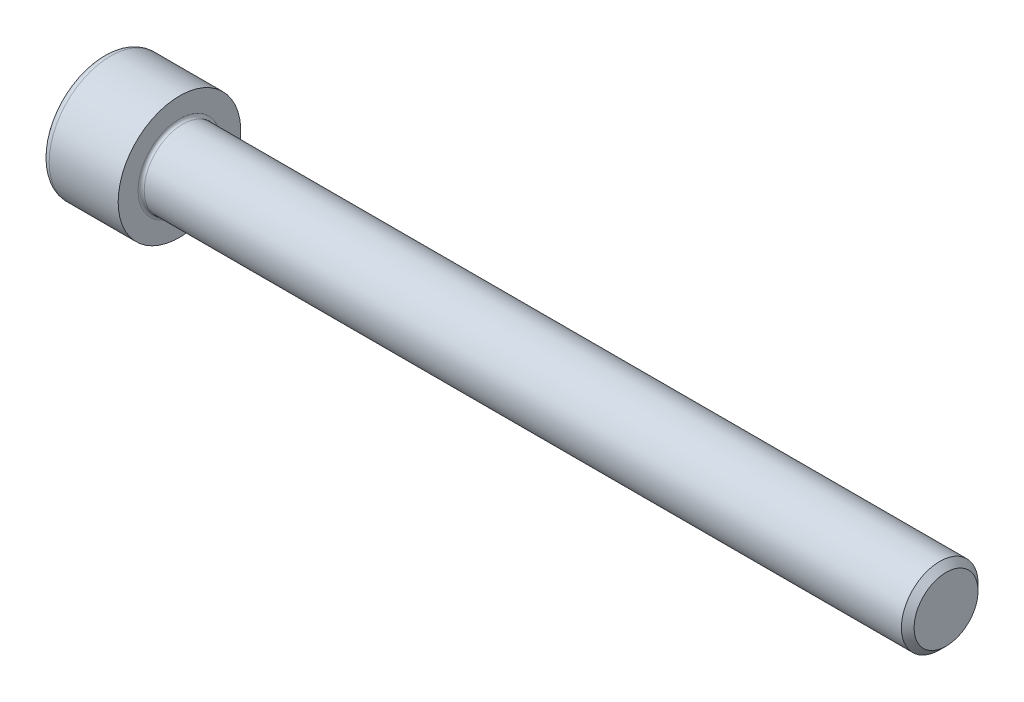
from build123d import *

# Parameters (mm, degrees)
FILLET1_R   = 0.4
FILLET2_R   = 1
HEX_2_DEPTH = 5


with BuildPart() as part:
    # BodySke → Base-Revolve (revolve)
    with BuildSketch(Plane.XY, mode=Mode.PRIVATE) as base_revolve_sk:
        Polygon((0, 0), (0, 8), (10, 8), (10, 5), (109.172, 5), (110, 4.172), (110, 0), align=None)
    revolve(base_revolve_sk.sketch.rotate(Axis((-31.75, 0, 0), (1, 0, 0)), 90), axis=Axis((-31.75, 0, 0), (1, 0, 0)))

    # Fillet1
    fillet1_edges = [part.edges().sort_by_distance(p)[0] for p in [
        (10, 0, -5),
    ]]
    fillet(fillet1_edges, radius=FILLET1_R)

    # Fillet2
    fillet2_edges = [part.edges().sort_by_distance(p)[0] for p in [
        (0, 0, -8),
    ]]
    fillet(fillet2_edges, radius=FILLET2_R)

    # Sketch2 → Hex-PreBroach (revolve, cut)
    with BuildSketch(Plane.XY, mode=Mode.PRIVATE) as hex_prebroach_sk:
        Polygon((0, 4.0125), (5, 4.0125), (7.316617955, 0), (0, 0), align=None)
    revolve(hex_prebroach_sk.sketch.rotate(Axis((0, 0, 0), (1, 0, 0)), 90), axis=Axis((0, 0, 0), (1, 0, 0)), mode=Mode.SUBTRACT)

    # Sketch3 → Hex 2 (cut)
    with BuildSketch(Plane(origin=(0, 0, 0), x_dir=(0, 0.500000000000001, 0.866025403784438), z_dir=(-1, 0, 0))):
        Polygon((2.316617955, 4.0125), (-2.316617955, 4.0125), (-4.63323591, 0), (-2.316617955, -4.0125), (2.316617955, -4.0125), (4.63323591, 0), align=None)
    extrude(amount=-HEX_2_DEPTH, mode=Mode.SUBTRACT)


solid = part.part
